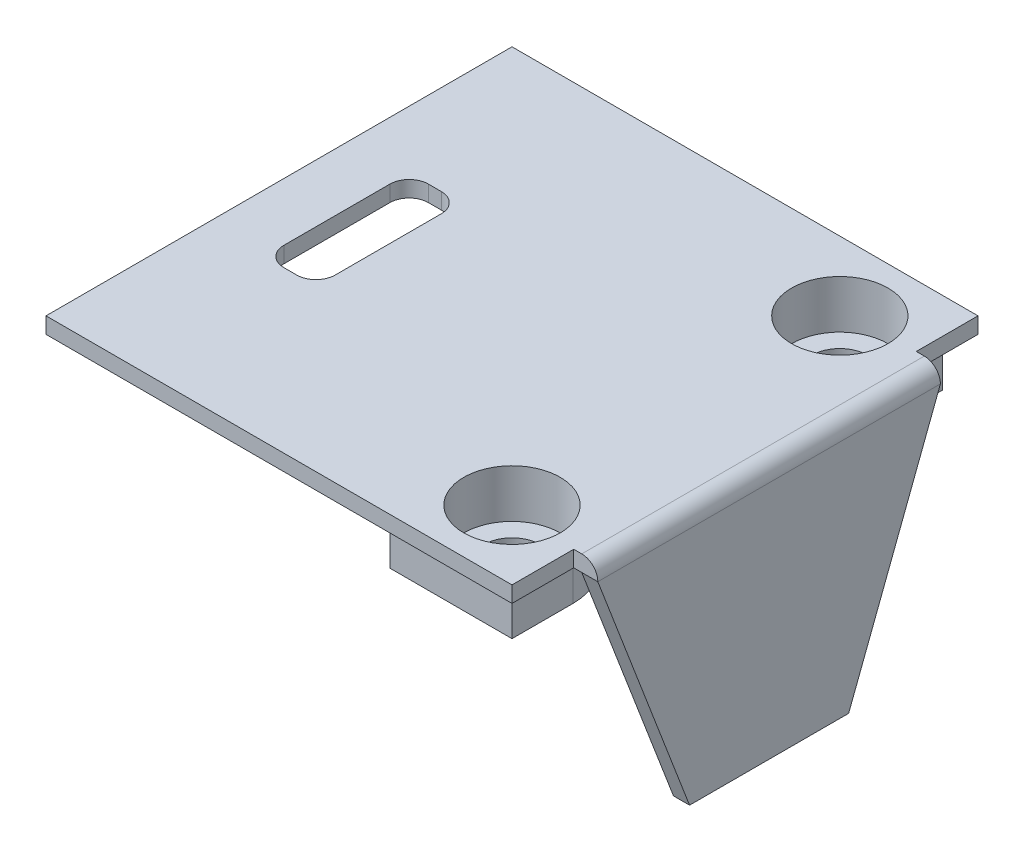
from build123d import *

# Parameters (mm, degrees)
SKIZZE1_W                       = 29
SKIZZE1_H                       = 29
AUFSATZ_LINEAR_AUSTRAGEN1_DEPTH = 1
AUFSATZ_LINEAR_AUSTRAGEN2_DEPTH = 1.5
AUFSATZ_LINEAR_AUSTRAGEN3_DEPTH = 1
AUFSATZ_LINEAR_AUSTRAGEN4_DEPTH = 0.5
AUFSATZ_LINEAR_AUSTRAGEN5_DEPTH = 3
SKIZZE7_R                       = 1.75
SCHNITT_LINEAR_AUSTRAGEN1_DEPTH = 4
SKIZZE8_R                       = 3
SCHNITT_LINEAR_AUSTRAGEN2_DEPTH = 3
SCHNITT_LINEAR_AUSTRAGEN4_DEPTH = 1
VERRUNDUNG1_R                   = 1


with BuildPart() as part:
    # Skizze1 → Aufsatz-Linear austragen1 (new body)
    with BuildSketch(Plane(origin=(0, 0, 0), x_dir=(1, 0, 0), z_dir=(0, 1, 0))):
        Rectangle(SKIZZE1_W, SKIZZE1_H)
    extrude(amount=AUFSATZ_LINEAR_AUSTRAGEN1_DEPTH)

    # Skizze2 → Aufsatz-Linear austragen2 (add)
    with BuildSketch(Plane(origin=(14.5, 0, 0), x_dir=(0, 0, -1), z_dir=(1, 0, 0))):
        Polygon((4.95, -13.9), (-4.95, -13.9), (-10.373156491, 1), (10.373156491, 1), align=None)
    extrude(amount=AUFSATZ_LINEAR_AUSTRAGEN2_DEPTH)

    # Skizze4 → Aufsatz-Linear austragen3 (add)
    with BuildSketch(Plane(origin=(16, 0, 0), x_dir=(0, 0, -1), z_dir=(1, 0, 0))):
        Polygon((10.659553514, 0), (4.95, -14.9), (-4.95, -14.9), (-10.659553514, 0), (-10.659553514, 1), (10.659553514, 1), align=None)
    extrude(amount=-AUFSATZ_LINEAR_AUSTRAGEN3_DEPTH)

    # Skizze5 → Aufsatz-Linear austragen4 (add)
    with BuildSketch(Plane.ZY.offset(-15)):
        Polygon((-10.373156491, 1), (-10.659553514, 1), (-10.659553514, 0), (-10.009186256, 0), align=None)
        Polygon((10.009186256, 0), (10.373156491, 1), (10.659553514, 1), (10.659553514, 0), align=None)
    extrude(amount=AUFSATZ_LINEAR_AUSTRAGEN4_DEPTH)

    # Skizze6 → Aufsatz-Linear austragen5 (add)
    with BuildSketch(Plane.XZ):
        with BuildLine():
            Line((13.4, 9.6), (13.4, 13.4))
            Line((13.4, 13.4), (5.8, 13.4))
            Line((5.8, 13.4), (5.8, 9.6))
            ThreePointArc((5.8, 9.6), (9.6, 5.8), (13.4, 9.6))
        make_face()
    aufsatz_linear_austragen5 = extrude(amount=AUFSATZ_LINEAR_AUSTRAGEN5_DEPTH)

    # Skizze7 → Schnitt-Linear austragen1 (cut)
    with BuildSketch(Plane(origin=(0, 1, 0), x_dir=(1, 0, 0), z_dir=(0, 1, 0))):
        with Locations(Location((10.2, -10.2, 0), (0, 0, 270))):
            Circle(SKIZZE7_R)
    schnitt_linear_austragen1 = extrude(amount=-SCHNITT_LINEAR_AUSTRAGEN1_DEPTH, mode=Mode.SUBTRACT)

    # Skizze8 → Schnitt-Linear austragen2 (cut)
    with BuildSketch(Plane(origin=(0, 1, 0), x_dir=(1, 0, 0), z_dir=(0, 1, 0))):
        with Locations(Location((10.2, -10.2, 0), (0, 0, 270))):
            Circle(SKIZZE8_R)
    schnitt_linear_austragen2 = extrude(amount=-SCHNITT_LINEAR_AUSTRAGEN2_DEPTH, mode=Mode.SUBTRACT)

    # Spiegeln1: Aufsatz-Linear austragen5, Schnitt-Linear austragen1, Schnitt-Linear austragen2 across plane
    add(aufsatz_linear_austragen5.mirror(Plane.XY))
    add(schnitt_linear_austragen1.mirror(Plane.XY), mode=Mode.SUBTRACT)
    add(schnitt_linear_austragen2.mirror(Plane.XY), mode=Mode.SUBTRACT)

    # Skizze9 → Schnitt-Linear austragen4 (cut)
    with BuildSketch(Plane(origin=(0, 1, 0), x_dir=(1, 0, 0), z_dir=(0, 1, 0))):
        with BuildLine():
            Line((-9.7, 4.5), (-8.9, 4.5))
            ThreePointArc((-8.9, 4.5), (-8.051471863, 4.148528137), (-7.7, 3.3))
            Line((-7.7, 3.3), (-7.7, -3.3))
            ThreePointArc((-7.7, -3.3), (-8.051471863, -4.148528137), (-8.9, -4.5))
            Line((-8.9, -4.5), (-9.7, -4.5))
            ThreePointArc((-9.7, -4.5), (-10.548528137, -4.148528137), (-10.9, -3.3))
            Line((-10.9, -3.3), (-10.9, 3.3))
            ThreePointArc((-10.9, 3.3), (-10.548528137, 4.148528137), (-9.7, 4.5))
        make_face()
    extrude(amount=-SCHNITT_LINEAR_AUSTRAGEN4_DEPTH, mode=Mode.SUBTRACT)

    # Verrundung1
    verrundung1_edges = [part.edges().sort_by_distance(p)[0] for p in [
        (16, 1, 0),
    ]]
    fillet(verrundung1_edges, radius=VERRUNDUNG1_R)


solid = part.part
